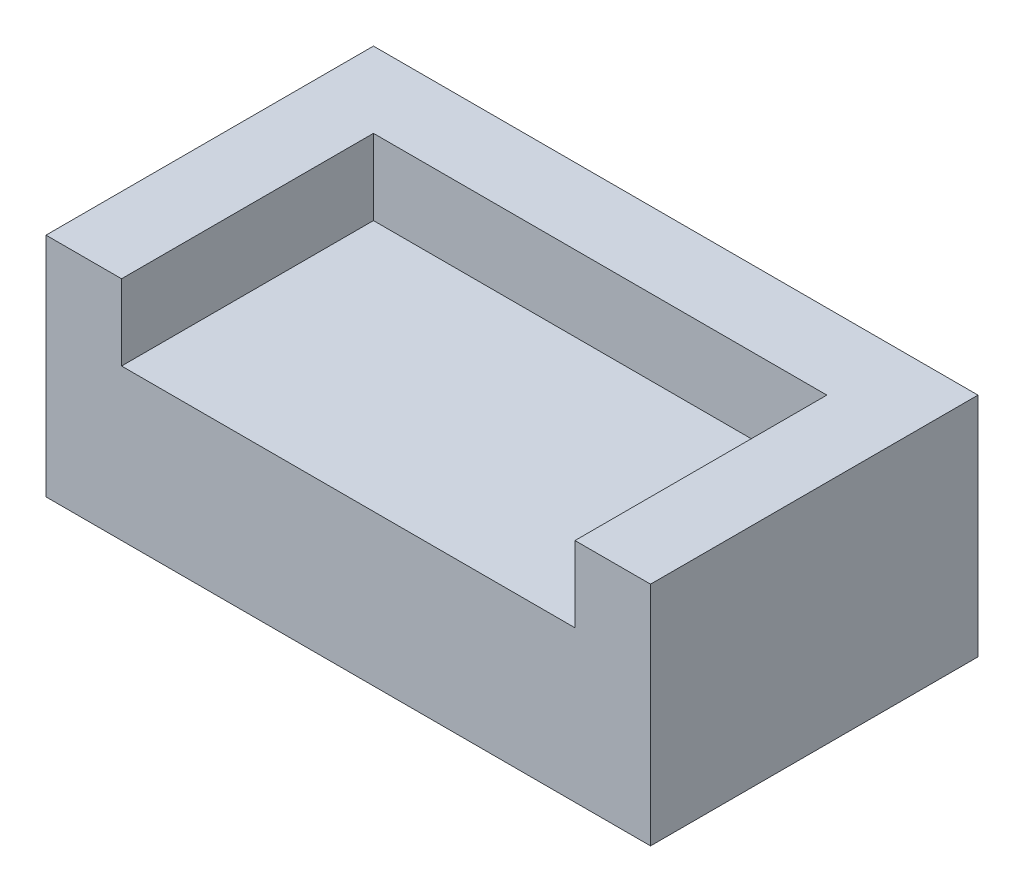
ISO-10303-21;
HEADER;
FILE_DESCRIPTION(('STEP AP214'),'2;1');
FILE_NAME('part.step','',(''),(''),'','','');
FILE_SCHEMA(('AUTOMOTIVE_DESIGN { 1 0 10303 214 1 1 1 1 }'));
ENDSEC;
DATA;
#1=APPLICATION_CONTEXT('core data for automotive mechanical design processes');
#2=APPLICATION_PROTOCOL_DEFINITION('international standard','automotive_design',2000,#1);
#3=PRODUCT_CONTEXT('',#1,'mechanical');
#4=PRODUCT('Part','Part','',(#3));
#5=PRODUCT_RELATED_PRODUCT_CATEGORY('part','',(#4));
#6=PRODUCT_DEFINITION_FORMATION('','',#4);
#7=PRODUCT_DEFINITION_CONTEXT('part definition',#1,'design');
#8=PRODUCT_DEFINITION('design','',#6,#7);
#9=PRODUCT_DEFINITION_SHAPE('','',#8);
#10=(LENGTH_UNIT() NAMED_UNIT(*) SI_UNIT(.MILLI.,.METRE.));
#11=(NAMED_UNIT(*) PLANE_ANGLE_UNIT() SI_UNIT($,.RADIAN.));
#12=(NAMED_UNIT(*) SI_UNIT($,.STERADIAN.) SOLID_ANGLE_UNIT());
#13=UNCERTAINTY_MEASURE_WITH_UNIT(LENGTH_MEASURE(1.E-05),#10,'distance_accuracy_value','');
#14=(GEOMETRIC_REPRESENTATION_CONTEXT(3) GLOBAL_UNCERTAINTY_ASSIGNED_CONTEXT((#13)) GLOBAL_UNIT_ASSIGNED_CONTEXT((#10,
#11,#12)) REPRESENTATION_CONTEXT('',''));
#15=CARTESIAN_POINT('',(0.,0.,0.));
#16=DIRECTION('',(0.,0.,1.));
#17=DIRECTION('',(1.,0.,0.));
#18=AXIS2_PLACEMENT_3D('',#15,#16,#17);
#19=CARTESIAN_POINT('',(-106.292846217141,30.,65.));
#20=DIRECTION('',(0.,0.,-1.));
#21=DIRECTION('',(-1.,0.,0.));
#22=AXIS2_PLACEMENT_3D('',#19,#20,#21);
#23=PLANE('',#22);
#24=DIRECTION('',(1.,0.,0.));
#25=VECTOR('',#24,1.);
#26=CARTESIAN_POINT('',(-106.292846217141,0.,65.));
#27=LINE('',#26,#25);
#28=CARTESIAN_POINT('',(-60.,0.,65.));
#29=VERTEX_POINT('',#28);
#30=CARTESIAN_POINT('',(60.,0.,65.));
#31=VERTEX_POINT('',#30);
#32=EDGE_CURVE('E34',#29,#31,#27,.T.);
#33=ORIENTED_EDGE('',*,*,#32,.T.);
#34=DIRECTION('',(0.,-1.,0.));
#35=VECTOR('',#34,1.);
#36=CARTESIAN_POINT('',(60.,45.,65.));
#37=LINE('',#36,#35);
#38=CARTESIAN_POINT('',(60.,45.,65.));
#39=VERTEX_POINT('',#38);
#40=EDGE_CURVE('E116',#39,#31,#37,.T.);
#41=ORIENTED_EDGE('',*,*,#40,.F.);
#42=DIRECTION('',(1.,0.,0.));
#43=VECTOR('',#42,1.);
#44=CARTESIAN_POINT('',(-106.292846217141,45.,65.));
#45=LINE('',#44,#43);
#46=CARTESIAN_POINT('',(45.,45.,65.));
#47=VERTEX_POINT('',#46);
#48=EDGE_CURVE('E101',#47,#39,#45,.T.);
#49=ORIENTED_EDGE('',*,*,#48,.F.);
#50=DIRECTION('',(0.,-1.,0.));
#51=VECTOR('',#50,1.);
#52=CARTESIAN_POINT('',(45.,45.,65.));
#53=LINE('',#52,#51);
#54=CARTESIAN_POINT('',(45.,30.,65.));
#55=VERTEX_POINT('',#54);
#56=EDGE_CURVE('E98',#47,#55,#53,.T.);
#57=ORIENTED_EDGE('',*,*,#56,.T.);
#58=DIRECTION('',(1.,0.,0.));
#59=VECTOR('',#58,1.);
#60=CARTESIAN_POINT('',(-106.292846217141,30.,65.));
#61=LINE('',#60,#59);
#62=CARTESIAN_POINT('',(-45.,30.,65.));
#63=VERTEX_POINT('',#62);
#64=EDGE_CURVE('E115',#63,#55,#61,.T.);
#65=ORIENTED_EDGE('',*,*,#64,.F.);
#66=DIRECTION('',(0.,-1.,0.));
#67=VECTOR('',#66,1.);
#68=CARTESIAN_POINT('',(-45.,45.,65.));
#69=LINE('',#68,#67);
#70=CARTESIAN_POINT('',(-45.,45.,65.));
#71=VERTEX_POINT('',#70);
#72=EDGE_CURVE('E152',#71,#63,#69,.T.);
#73=ORIENTED_EDGE('',*,*,#72,.F.);
#74=DIRECTION('',(1.,0.,0.));
#75=VECTOR('',#74,1.);
#76=CARTESIAN_POINT('',(-106.292846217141,45.,65.));
#77=LINE('',#76,#75);
#78=CARTESIAN_POINT('',(-60.,45.,65.));
#79=VERTEX_POINT('',#78);
#80=EDGE_CURVE('E139',#79,#71,#77,.T.);
#81=ORIENTED_EDGE('',*,*,#80,.F.);
#82=DIRECTION('',(0.,-1.,0.));
#83=VECTOR('',#82,1.);
#84=CARTESIAN_POINT('',(-60.,45.,65.));
#85=LINE('',#84,#83);
#86=EDGE_CURVE('E154',#79,#29,#85,.T.);
#87=ORIENTED_EDGE('',*,*,#86,.T.);
#88=EDGE_LOOP('',(#33,#41,#49,#57,#65,#73,#81,#87));
#89=FACE_BOUND('',#88,.T.);
#90=ADVANCED_FACE('F31',(#89),#23,.F.);
#91=CARTESIAN_POINT('',(-106.292846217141,30.,32.5));
#92=DIRECTION('',(0.,1.,0.));
#93=DIRECTION('',(0.,0.,1.));
#94=AXIS2_PLACEMENT_3D('',#91,#92,#93);
#95=PLANE('',#94);
#96=ORIENTED_EDGE('',*,*,#64,.T.);
#97=DIRECTION('',(0.,0.,1.));
#98=VECTOR('',#97,1.);
#99=CARTESIAN_POINT('',(45.,30.,32.5));
#100=LINE('',#99,#98);
#101=CARTESIAN_POINT('',(45.,30.,15.));
#102=VERTEX_POINT('',#101);
#103=EDGE_CURVE('E121',#102,#55,#100,.T.);
#104=ORIENTED_EDGE('',*,*,#103,.F.);
#105=DIRECTION('',(1.,0.,0.));
#106=VECTOR('',#105,1.);
#107=CARTESIAN_POINT('',(-106.292846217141,30.,15.));
#108=LINE('',#107,#106);
#109=CARTESIAN_POINT('',(-45.,30.,15.));
#110=VERTEX_POINT('',#109);
#111=EDGE_CURVE('E39',#110,#102,#108,.T.);
#112=ORIENTED_EDGE('',*,*,#111,.F.);
#113=DIRECTION('',(0.,0.,1.));
#114=VECTOR('',#113,1.);
#115=CARTESIAN_POINT('',(-45.,30.,32.5));
#116=LINE('',#115,#114);
#117=EDGE_CURVE('E11',#110,#63,#116,.T.);
#118=ORIENTED_EDGE('',*,*,#117,.T.);
#119=EDGE_LOOP('',(#96,#104,#112,#118));
#120=FACE_BOUND('',#119,.T.);
#121=ADVANCED_FACE('F186',(#120),#95,.T.);
#122=CARTESIAN_POINT('',(-106.292846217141,0.,32.5));
#123=DIRECTION('',(0.,1.,0.));
#124=DIRECTION('',(0.,0.,1.));
#125=AXIS2_PLACEMENT_3D('',#122,#123,#124);
#126=PLANE('',#125);
#127=DIRECTION('',(0.,0.,1.));
#128=VECTOR('',#127,1.);
#129=CARTESIAN_POINT('',(60.,0.,32.5));
#130=LINE('',#129,#128);
#131=CARTESIAN_POINT('',(60.,0.,0.));
#132=VERTEX_POINT('',#131);
#133=EDGE_CURVE('E143',#132,#31,#130,.T.);
#134=ORIENTED_EDGE('',*,*,#133,.T.);
#135=ORIENTED_EDGE('',*,*,#32,.F.);
#136=DIRECTION('',(0.,0.,1.));
#137=VECTOR('',#136,1.);
#138=CARTESIAN_POINT('',(-60.,0.,32.5));
#139=LINE('',#138,#137);
#140=CARTESIAN_POINT('',(-60.,0.,0.));
#141=VERTEX_POINT('',#140);
#142=EDGE_CURVE('E111',#141,#29,#139,.T.);
#143=ORIENTED_EDGE('',*,*,#142,.F.);
#144=DIRECTION('',(1.,0.,0.));
#145=VECTOR('',#144,1.);
#146=CARTESIAN_POINT('',(-106.292846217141,0.,0.));
#147=LINE('',#146,#145);
#148=EDGE_CURVE('E146',#141,#132,#147,.T.);
#149=ORIENTED_EDGE('',*,*,#148,.T.);
#150=EDGE_LOOP('',(#134,#135,#143,#149));
#151=FACE_BOUND('',#150,.T.);
#152=ADVANCED_FACE('F164',(#151),#126,.F.);
#153=CARTESIAN_POINT('',(-106.292846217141,45.,15.));
#154=DIRECTION('',(0.,0.,-1.));
#155=DIRECTION('',(-1.,0.,0.));
#156=AXIS2_PLACEMENT_3D('',#153,#154,#155);
#157=PLANE('',#156);
#158=ORIENTED_EDGE('',*,*,#111,.T.);
#159=DIRECTION('',(0.,-1.,0.));
#160=VECTOR('',#159,1.);
#161=CARTESIAN_POINT('',(45.,45.,15.));
#162=LINE('',#161,#160);
#163=CARTESIAN_POINT('',(45.,45.,15.));
#164=VERTEX_POINT('',#163);
#165=EDGE_CURVE('E96',#164,#102,#162,.T.);
#166=ORIENTED_EDGE('',*,*,#165,.F.);
#167=DIRECTION('',(1.,0.,0.));
#168=VECTOR('',#167,1.);
#169=CARTESIAN_POINT('',(-106.292846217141,45.,15.));
#170=LINE('',#169,#168);
#171=CARTESIAN_POINT('',(-45.,45.,15.));
#172=VERTEX_POINT('',#171);
#173=EDGE_CURVE('E102',#172,#164,#170,.T.);
#174=ORIENTED_EDGE('',*,*,#173,.F.);
#175=DIRECTION('',(0.,-1.,0.));
#176=VECTOR('',#175,1.);
#177=CARTESIAN_POINT('',(-45.,45.,15.));
#178=LINE('',#177,#176);
#179=EDGE_CURVE('E142',#172,#110,#178,.T.);
#180=ORIENTED_EDGE('',*,*,#179,.T.);
#181=EDGE_LOOP('',(#158,#166,#174,#180));
#182=FACE_BOUND('',#181,.T.);
#183=ADVANCED_FACE('F113',(#182),#157,.F.);
#184=CARTESIAN_POINT('',(45.,45.,32.5));
#185=DIRECTION('',(1.,0.,0.));
#186=DIRECTION('',(0.,0.,-1.));
#187=AXIS2_PLACEMENT_3D('',#184,#185,#186);
#188=PLANE('',#187);
#189=ORIENTED_EDGE('',*,*,#103,.T.);
#190=ORIENTED_EDGE('',*,*,#56,.F.);
#191=DIRECTION('',(0.,0.,1.));
#192=VECTOR('',#191,1.);
#193=CARTESIAN_POINT('',(45.,45.,32.5));
#194=LINE('',#193,#192);
#195=EDGE_CURVE('E91',#164,#47,#194,.T.);
#196=ORIENTED_EDGE('',*,*,#195,.F.);
#197=ORIENTED_EDGE('',*,*,#165,.T.);
#198=EDGE_LOOP('',(#189,#190,#196,#197));
#199=FACE_BOUND('',#198,.T.);
#200=ADVANCED_FACE('F94',(#199),#188,.F.);
#201=CARTESIAN_POINT('',(60.,45.,32.5));
#202=DIRECTION('',(1.,0.,0.));
#203=DIRECTION('',(0.,0.,-1.));
#204=AXIS2_PLACEMENT_3D('',#201,#202,#203);
#205=PLANE('',#204);
#206=ORIENTED_EDGE('',*,*,#133,.F.);
#207=DIRECTION('',(0.,-1.,0.));
#208=VECTOR('',#207,1.);
#209=CARTESIAN_POINT('',(60.,45.,0.));
#210=LINE('',#209,#208);
#211=CARTESIAN_POINT('',(60.,45.,0.));
#212=VERTEX_POINT('',#211);
#213=EDGE_CURVE('E159',#212,#132,#210,.T.);
#214=ORIENTED_EDGE('',*,*,#213,.F.);
#215=DIRECTION('',(0.,0.,1.));
#216=VECTOR('',#215,1.);
#217=CARTESIAN_POINT('',(60.,45.,32.5));
#218=LINE('',#217,#216);
#219=EDGE_CURVE('E130',#212,#39,#218,.T.);
#220=ORIENTED_EDGE('',*,*,#219,.T.);
#221=ORIENTED_EDGE('',*,*,#40,.T.);
#222=EDGE_LOOP('',(#206,#214,#220,#221));
#223=FACE_BOUND('',#222,.T.);
#224=ADVANCED_FACE('F162',(#223),#205,.T.);
#225=CARTESIAN_POINT('',(-106.292846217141,45.,0.));
#226=DIRECTION('',(0.,0.,-1.));
#227=DIRECTION('',(-1.,0.,0.));
#228=AXIS2_PLACEMENT_3D('',#225,#226,#227);
#229=PLANE('',#228);
#230=ORIENTED_EDGE('',*,*,#148,.F.);
#231=DIRECTION('',(0.,-1.,0.));
#232=VECTOR('',#231,1.);
#233=CARTESIAN_POINT('',(-60.,45.,0.));
#234=LINE('',#233,#232);
#235=CARTESIAN_POINT('',(-60.,45.,0.));
#236=VERTEX_POINT('',#235);
#237=EDGE_CURVE('E157',#236,#141,#234,.T.);
#238=ORIENTED_EDGE('',*,*,#237,.F.);
#239=DIRECTION('',(1.,0.,0.));
#240=VECTOR('',#239,1.);
#241=CARTESIAN_POINT('',(-106.292846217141,45.,0.));
#242=LINE('',#241,#240);
#243=EDGE_CURVE('E132',#236,#212,#242,.T.);
#244=ORIENTED_EDGE('',*,*,#243,.T.);
#245=ORIENTED_EDGE('',*,*,#213,.T.);
#246=EDGE_LOOP('',(#230,#238,#244,#245));
#247=FACE_BOUND('',#246,.T.);
#248=ADVANCED_FACE('F168',(#247),#229,.T.);
#249=CARTESIAN_POINT('',(-60.,45.,32.5));
#250=DIRECTION('',(1.,0.,0.));
#251=DIRECTION('',(0.,0.,-1.));
#252=AXIS2_PLACEMENT_3D('',#249,#250,#251);
#253=PLANE('',#252);
#254=ORIENTED_EDGE('',*,*,#142,.T.);
#255=ORIENTED_EDGE('',*,*,#86,.F.);
#256=DIRECTION('',(0.,0.,1.));
#257=VECTOR('',#256,1.);
#258=CARTESIAN_POINT('',(-60.,45.,32.5));
#259=LINE('',#258,#257);
#260=EDGE_CURVE('E137',#236,#79,#259,.T.);
#261=ORIENTED_EDGE('',*,*,#260,.F.);
#262=ORIENTED_EDGE('',*,*,#237,.T.);
#263=EDGE_LOOP('',(#254,#255,#261,#262));
#264=FACE_BOUND('',#263,.T.);
#265=ADVANCED_FACE('F174',(#264),#253,.F.);
#266=CARTESIAN_POINT('',(-45.,45.,32.5));
#267=DIRECTION('',(1.,0.,0.));
#268=DIRECTION('',(0.,0.,-1.));
#269=AXIS2_PLACEMENT_3D('',#266,#267,#268);
#270=PLANE('',#269);
#271=ORIENTED_EDGE('',*,*,#72,.T.);
#272=ORIENTED_EDGE('',*,*,#117,.F.);
#273=ORIENTED_EDGE('',*,*,#179,.F.);
#274=DIRECTION('',(0.,0.,1.));
#275=VECTOR('',#274,1.);
#276=CARTESIAN_POINT('',(-45.,45.,32.5));
#277=LINE('',#276,#275);
#278=EDGE_CURVE('E108',#172,#71,#277,.T.);
#279=ORIENTED_EDGE('',*,*,#278,.T.);
#280=EDGE_LOOP('',(#271,#272,#273,#279));
#281=FACE_BOUND('',#280,.T.);
#282=ADVANCED_FACE('F176',(#281),#270,.T.);
#283=CARTESIAN_POINT('',(-106.292846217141,45.,32.5));
#284=DIRECTION('',(0.,1.,0.));
#285=DIRECTION('',(0.,0.,1.));
#286=AXIS2_PLACEMENT_3D('',#283,#284,#285);
#287=PLANE('',#286);
#288=ORIENTED_EDGE('',*,*,#173,.T.);
#289=ORIENTED_EDGE('',*,*,#195,.T.);
#290=ORIENTED_EDGE('',*,*,#48,.T.);
#291=ORIENTED_EDGE('',*,*,#219,.F.);
#292=ORIENTED_EDGE('',*,*,#243,.F.);
#293=ORIENTED_EDGE('',*,*,#260,.T.);
#294=ORIENTED_EDGE('',*,*,#80,.T.);
#295=ORIENTED_EDGE('',*,*,#278,.F.);
#296=EDGE_LOOP('',(#288,#289,#290,#291,#292,#293,#294,#295));
#297=FACE_BOUND('',#296,.T.);
#298=ADVANCED_FACE('F106',(#297),#287,.T.);
#299=CLOSED_SHELL('',(#90,#121,#152,#183,#200,#224,#248,#265,#282,#298));
#300=MANIFOLD_SOLID_BREP('B2',#299);
#301=ADVANCED_BREP_SHAPE_REPRESENTATION('',(#18,#300),#14);
#302=SHAPE_DEFINITION_REPRESENTATION(#9,#301);
ENDSEC;
END-ISO-10303-21;
